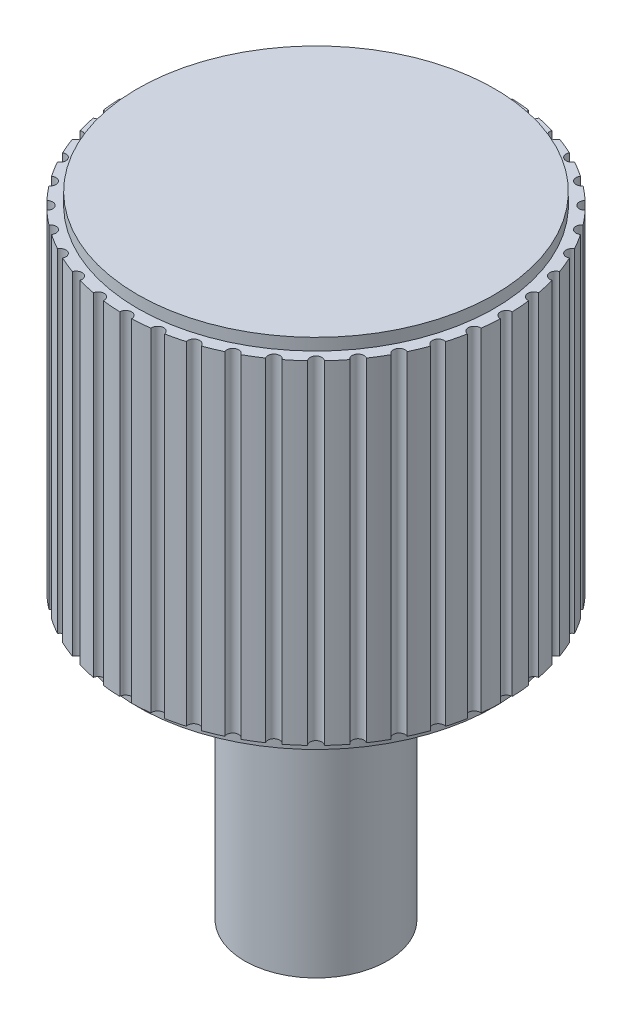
from build123d import *

# Parameters (mm, degrees)
SKETCH2_R          = 1.6
SKETCH2_R_2        = 1.5
CUT_EXTRUDE1_DEPTH = 0.1
CUT_EXTRUDE2_START = -0.1
SKETCH3_R          = 1.6
SKETCH3_R_2        = 1.5
CUT_EXTRUDE2_DEPTH = 0.1
SKETCH4_R          = 0.05
CUT_EXTRUDE3_DEPTH = 6.762811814


with BuildPart() as part:
    # Sketch1 → Revolve1 (revolve)
    with BuildSketch(Plane.XY, mode=Mode.PRIVATE) as revolve1_sk:
        Polygon((0, 0), (-0.6, 0), (-0.6, 2.3), (-1.6, 2.3), (-1.6, 5.3), (0, 5.3), align=None)
    revolve(revolve1_sk.sketch.rotate(Axis((0, 2.9163389, 0), (0, -1, 0)), 270), axis=Axis((0, 2.9163389, 0), (0, -1, 0)))

    # Sketch2 → Cut-Extrude1 (cut)
    with BuildSketch(Plane(origin=(0, 5.3, 0), x_dir=(1, 0, 0), z_dir=(0, 1, 0))):
        with Locations(Location((0, 0, 0), (0, 0, 270))):
            Circle(SKETCH2_R)
        with Locations(Location((0, 0, 0), (0, 0, 270))):
            Circle(SKETCH2_R_2, mode=Mode.SUBTRACT)
    extrude(amount=-CUT_EXTRUDE1_DEPTH, mode=Mode.SUBTRACT)

    # Sketch3 → Cut-Extrude2 (cut)
    with BuildSketch(Plane.XZ.offset(-2.3).offset(CUT_EXTRUDE2_START)):
        with Locations(Location((0, 0, 0), (0, 0, 90))):
            Circle(SKETCH3_R)
        with Locations(Location((0, 0, 0), (0, 0, 90))):
            Circle(SKETCH3_R_2, mode=Mode.SUBTRACT)
    extrude(amount=CUT_EXTRUDE2_DEPTH, mode=Mode.SUBTRACT)

    # Sketch4 → Cut-Extrude3 (cut, through all)
    with BuildSketch(Plane(origin=(0, 5.3, 0), x_dir=(1, 0, 0), z_dir=(0, 1, 0))):
        with Locations((0, 1.6)):
            Circle(SKETCH4_R)
        with Locations((0.250295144, 1.580301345)):
            Circle(SKETCH4_R)
        with Locations((0.494427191, 1.521690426)):
            Circle(SKETCH4_R)
        with Locations((0.7263848, 1.425610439)):
            Circle(SKETCH4_R)
        with Locations((0.940456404, 1.294427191)):
            Circle(SKETCH4_R)
        with Locations((1.13137085, 1.13137085)):
            Circle(SKETCH4_R)
        with Locations((1.294427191, 0.940456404)):
            Circle(SKETCH4_R)
        with Locations((1.425610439, 0.7263848)):
            Circle(SKETCH4_R)
        with Locations((1.521690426, 0.494427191)):
            Circle(SKETCH4_R)
        with Locations((1.580301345, 0.250295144)):
            Circle(SKETCH4_R)
        with Locations((1.6, 0)):
            Circle(SKETCH4_R)
        with Locations((1.580301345, -0.250295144)):
            Circle(SKETCH4_R)
        with Locations((1.521690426, -0.494427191)):
            Circle(SKETCH4_R)
        with Locations((1.425610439, -0.7263848)):
            Circle(SKETCH4_R)
        with Locations((1.294427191, -0.940456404)):
            Circle(SKETCH4_R)
        with Locations((1.13137085, -1.13137085)):
            Circle(SKETCH4_R)
        with Locations((0.940456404, -1.294427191)):
            Circle(SKETCH4_R)
        with Locations((0.7263848, -1.425610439)):
            Circle(SKETCH4_R)
        with Locations((0.494427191, -1.521690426)):
            Circle(SKETCH4_R)
        with Locations((0.250295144, -1.580301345)):
            Circle(SKETCH4_R)
        with Locations((0, -1.6)):
            Circle(SKETCH4_R)
        with Locations((-0.250295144, -1.580301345)):
            Circle(SKETCH4_R)
        with Locations((-0.494427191, -1.521690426)):
            Circle(SKETCH4_R)
        with Locations((-0.7263848, -1.425610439)):
            Circle(SKETCH4_R)
        with Locations((-0.940456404, -1.294427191)):
            Circle(SKETCH4_R)
        with Locations((-1.13137085, -1.13137085)):
            Circle(SKETCH4_R)
        with Locations((-1.294427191, -0.940456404)):
            Circle(SKETCH4_R)
        with Locations((-1.425610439, -0.7263848)):
            Circle(SKETCH4_R)
        with Locations((-1.521690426, -0.494427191)):
            Circle(SKETCH4_R)
        with Locations((-1.580301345, -0.250295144)):
            Circle(SKETCH4_R)
        with Locations((-1.6, 0)):
            Circle(SKETCH4_R)
        with Locations((-1.580301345, 0.250295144)):
            Circle(SKETCH4_R)
        with Locations((-1.521690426, 0.494427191)):
            Circle(SKETCH4_R)
        with Locations((-1.425610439, 0.7263848)):
            Circle(SKETCH4_R)
        with Locations((-1.294427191, 0.940456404)):
            Circle(SKETCH4_R)
        with Locations((-1.13137085, 1.13137085)):
            Circle(SKETCH4_R)
        with Locations((-0.940456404, 1.294427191)):
            Circle(SKETCH4_R)
        with Locations((-0.7263848, 1.425610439)):
            Circle(SKETCH4_R)
        with Locations((-0.494427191, 1.521690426)):
            Circle(SKETCH4_R)
        with Locations((-0.250295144, 1.580301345)):
            Circle(SKETCH4_R)
    extrude(amount=-CUT_EXTRUDE3_DEPTH, mode=Mode.SUBTRACT)


solid = part.part
